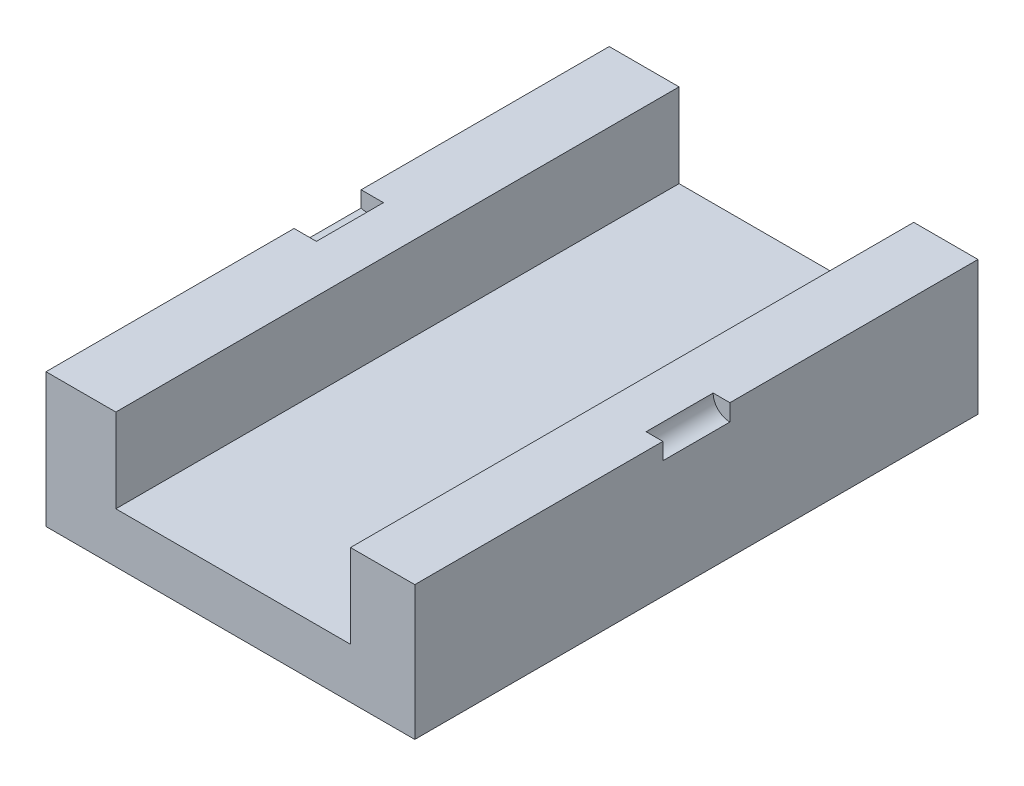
from build123d import *

# Parameters (mm, degrees)
BOSS_EXTRUDE1_DEPTH = 84
SKETCH3_W           = 20
SKETCH3_H           = 5


with BuildPart() as part:
    # Sketch2 → Boss-Extrude1 (new, symmetric)
    with BuildSketch(Plane.XY):
        Polygon((-48.200692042, 19.740484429), (-48.200692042, -5.259515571), (21.799307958, -5.259515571), (21.799307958, 19.740484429), (40.968858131, 19.740484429), (40.968858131, -20.259515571), (-69.031141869, -20.259515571), (-69.031141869, 19.740484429), align=None)
    extrude(amount=BOSS_EXTRUDE1_DEPTH, both=True)

    # Sketch3 → Cut-Revolve1 (revolve, cut)
    with BuildSketch(Plane(origin=(40.968858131, 0, 0), x_dir=(0, 0, -1), z_dir=(1, 0, 0))):
        with Locations((0, 17.240484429)):
            Rectangle(SKETCH3_W, SKETCH3_H)
    cut_revolve1 = revolve(axis=Axis((40.968858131, 19.740484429, 18.33844843), (0, 0, -1)), mode=Mode.SUBTRACT)

    # Mirror1: Cut-Revolve1 across plane
    add(cut_revolve1.mirror(Plane(origin=(-13.200692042, 0, 0), x_dir=(0, 0, 1), z_dir=(1, 0, 0))), mode=Mode.SUBTRACT)


solid = part.part
